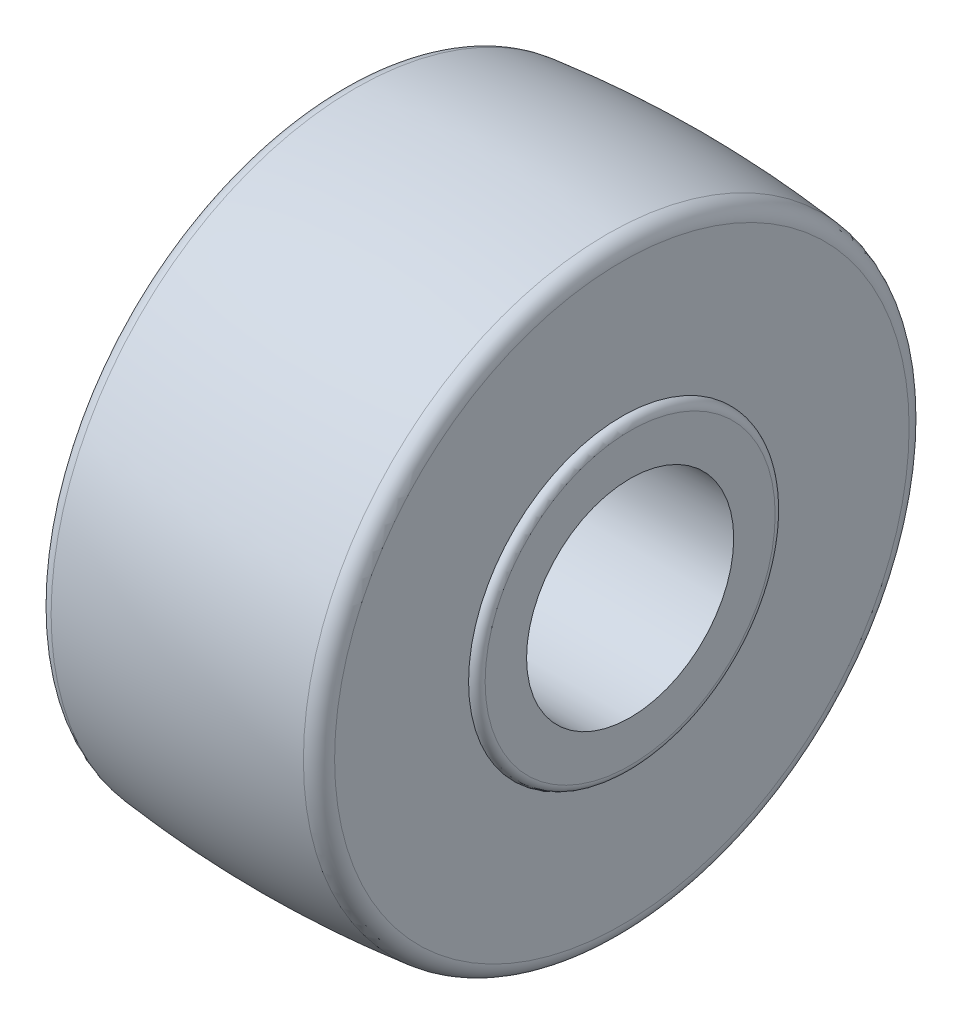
ISO-10303-21;
HEADER;
FILE_DESCRIPTION(('STEP AP214'),'2;1');
FILE_NAME('part.step','',(''),(''),'','','');
FILE_SCHEMA(('AUTOMOTIVE_DESIGN { 1 0 10303 214 1 1 1 1 }'));
ENDSEC;
DATA;
#1=APPLICATION_CONTEXT('core data for automotive mechanical design processes');
#2=APPLICATION_PROTOCOL_DEFINITION('international standard','automotive_design',2000,#1);
#3=PRODUCT_CONTEXT('',#1,'mechanical');
#4=PRODUCT('Part','Part','',(#3));
#5=PRODUCT_RELATED_PRODUCT_CATEGORY('part','',(#4));
#6=PRODUCT_DEFINITION_FORMATION('','',#4);
#7=PRODUCT_DEFINITION_CONTEXT('part definition',#1,'design');
#8=PRODUCT_DEFINITION('design','',#6,#7);
#9=PRODUCT_DEFINITION_SHAPE('','',#8);
#10=(LENGTH_UNIT() NAMED_UNIT(*) SI_UNIT(.MILLI.,.METRE.));
#11=(NAMED_UNIT(*) PLANE_ANGLE_UNIT() SI_UNIT($,.RADIAN.));
#12=(NAMED_UNIT(*) SI_UNIT($,.STERADIAN.) SOLID_ANGLE_UNIT());
#13=UNCERTAINTY_MEASURE_WITH_UNIT(LENGTH_MEASURE(1.E-05),#10,'distance_accuracy_value','');
#14=(GEOMETRIC_REPRESENTATION_CONTEXT(3) GLOBAL_UNCERTAINTY_ASSIGNED_CONTEXT((#13)) GLOBAL_UNIT_ASSIGNED_CONTEXT((#10,
#11,#12)) REPRESENTATION_CONTEXT('',''));
#15=CARTESIAN_POINT('',(0.,0.,0.));
#16=DIRECTION('',(0.,0.,1.));
#17=DIRECTION('',(1.,0.,0.));
#18=AXIS2_PLACEMENT_3D('',#15,#16,#17);
#19=CARTESIAN_POINT('',(18.,0.,0.));
#20=DIRECTION('',(-1.,0.,0.));
#21=DIRECTION('',(0.,0.,1.));
#22=AXIS2_PLACEMENT_3D('',#19,#20,#21);
#23=CYLINDRICAL_SURFACE('',#22,12.5);
#24=CARTESIAN_POINT('',(18.,0.,0.));
#25=DIRECTION('',(-1.,0.,0.));
#26=DIRECTION('',(0.,0.,1.));
#27=AXIS2_PLACEMENT_3D('',#24,#25,#26);
#28=CIRCLE('',#27,12.5);
#29=CARTESIAN_POINT('',(18.,0.,12.5));
#30=VERTEX_POINT('',#29);
#31=EDGE_CURVE('E141',#30,#30,#28,.F.);
#32=ORIENTED_EDGE('',*,*,#31,.T.);
#33=EDGE_LOOP('',(#32));
#34=FACE_BOUND('',#33,.T.);
#35=CARTESIAN_POINT('',(-18.,0.,0.));
#36=DIRECTION('',(-1.,0.,0.));
#37=DIRECTION('',(0.,0.,1.));
#38=AXIS2_PLACEMENT_3D('',#35,#36,#37);
#39=CIRCLE('',#38,12.5);
#40=CARTESIAN_POINT('',(-18.,0.,12.5));
#41=VERTEX_POINT('',#40);
#42=EDGE_CURVE('E64',#41,#41,#39,.T.);
#43=ORIENTED_EDGE('',*,*,#42,.T.);
#44=EDGE_LOOP('',(#43));
#45=FACE_BOUND('',#44,.T.);
#46=ADVANCED_FACE('F17',(#34,#45),#23,.F.);
#47=CARTESIAN_POINT('',(18.,12.5,0.));
#48=DIRECTION('',(-1.,0.,0.));
#49=DIRECTION('',(0.,0.,1.));
#50=AXIS2_PLACEMENT_3D('',#47,#48,#49);
#51=PLANE('',#50);
#52=ORIENTED_EDGE('',*,*,#31,.F.);
#53=EDGE_LOOP('',(#52));
#54=FACE_BOUND('',#53,.T.);
#55=CARTESIAN_POINT('',(18.,0.,0.));
#56=DIRECTION('',(-1.,0.,0.));
#57=DIRECTION('',(0.,0.,-1.));
#58=AXIS2_PLACEMENT_3D('',#55,#56,#57);
#59=CIRCLE('',#58,17.5);
#60=CARTESIAN_POINT('',(18.,0.,-17.5));
#61=VERTEX_POINT('',#60);
#62=CARTESIAN_POINT('',(18.,0.,17.5));
#63=VERTEX_POINT('',#62);
#64=EDGE_CURVE('E60',#61,#63,#59,.T.);
#65=ORIENTED_EDGE('',*,*,#64,.F.);
#66=CARTESIAN_POINT('',(18.,0.,0.));
#67=DIRECTION('',(-1.,0.,0.));
#68=DIRECTION('',(0.,0.,1.));
#69=AXIS2_PLACEMENT_3D('',#66,#67,#68);
#70=CIRCLE('',#69,17.5);
#71=EDGE_CURVE('E57',#63,#61,#70,.T.);
#72=ORIENTED_EDGE('',*,*,#71,.F.);
#73=EDGE_LOOP('',(#65,#72));
#74=FACE_BOUND('',#73,.T.);
#75=ADVANCED_FACE('F62',(#54,#74),#51,.F.);
#76=CARTESIAN_POINT('',(-18.,17.5,0.));
#77=DIRECTION('',(1.,0.,0.));
#78=DIRECTION('',(0.,0.,-1.));
#79=AXIS2_PLACEMENT_3D('',#76,#77,#78);
#80=PLANE('',#79);
#81=CARTESIAN_POINT('',(-18.,0.,0.));
#82=DIRECTION('',(1.,0.,0.));
#83=DIRECTION('',(0.,0.,1.));
#84=AXIS2_PLACEMENT_3D('',#81,#82,#83);
#85=CIRCLE('',#84,17.5);
#86=CARTESIAN_POINT('',(-18.,0.,17.5));
#87=VERTEX_POINT('',#86);
#88=CARTESIAN_POINT('',(-18.,0.,-17.5));
#89=VERTEX_POINT('',#88);
#90=EDGE_CURVE('E69',#87,#89,#85,.T.);
#91=ORIENTED_EDGE('',*,*,#90,.F.);
#92=CARTESIAN_POINT('',(-18.,0.,0.));
#93=DIRECTION('',(1.,0.,0.));
#94=DIRECTION('',(0.,0.,-1.));
#95=AXIS2_PLACEMENT_3D('',#92,#93,#94);
#96=CIRCLE('',#95,17.5);
#97=EDGE_CURVE('E114',#89,#87,#96,.T.);
#98=ORIENTED_EDGE('',*,*,#97,.F.);
#99=EDGE_LOOP('',(#91,#98));
#100=FACE_BOUND('',#99,.T.);
#101=ORIENTED_EDGE('',*,*,#42,.F.);
#102=EDGE_LOOP('',(#101));
#103=FACE_BOUND('',#102,.T.);
#104=ADVANCED_FACE('F90',(#100,#103),#80,.F.);
#105=CARTESIAN_POINT('',(17.,0.,0.));
#106=DIRECTION('',(-1.,0.,0.));
#107=DIRECTION('',(0.,0.,1.));
#108=AXIS2_PLACEMENT_3D('',#105,#106,#107);
#109=TOROIDAL_SURFACE('',#108,17.5,1.00000000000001);
#110=CARTESIAN_POINT('',(17.,0.,0.));
#111=DIRECTION('',(-1.,0.,0.));
#112=DIRECTION('',(0.,0.,1.));
#113=AXIS2_PLACEMENT_3D('',#110,#111,#112);
#114=CIRCLE('',#113,18.5);
#115=CARTESIAN_POINT('',(17.,0.,18.5));
#116=VERTEX_POINT('',#115);
#117=EDGE_CURVE('E133',#116,#116,#114,.F.);
#118=ORIENTED_EDGE('',*,*,#117,.T.);
#119=EDGE_LOOP('',(#118));
#120=FACE_BOUND('',#119,.T.);
#121=ORIENTED_EDGE('',*,*,#71,.T.);
#122=ORIENTED_EDGE('',*,*,#64,.T.);
#123=EDGE_LOOP('',(#121,#122));
#124=FACE_BOUND('',#123,.T.);
#125=ADVANCED_FACE('F68',(#120,#124),#109,.T.);
#126=CARTESIAN_POINT('',(-17.,0.,0.));
#127=DIRECTION('',(-1.,0.,0.));
#128=DIRECTION('',(0.,0.,1.));
#129=AXIS2_PLACEMENT_3D('',#126,#127,#128);
#130=TOROIDAL_SURFACE('',#129,17.5,1.00000000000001);
#131=ORIENTED_EDGE('',*,*,#90,.T.);
#132=ORIENTED_EDGE('',*,*,#97,.T.);
#133=EDGE_LOOP('',(#131,#132));
#134=FACE_BOUND('',#133,.T.);
#135=CARTESIAN_POINT('',(-17.,0.,0.));
#136=DIRECTION('',(-1.,0.,0.));
#137=DIRECTION('',(0.,0.,1.));
#138=AXIS2_PLACEMENT_3D('',#135,#136,#137);
#139=CIRCLE('',#138,18.5);
#140=CARTESIAN_POINT('',(-17.,0.,18.5));
#141=VERTEX_POINT('',#140);
#142=EDGE_CURVE('E77',#141,#141,#139,.T.);
#143=ORIENTED_EDGE('',*,*,#142,.T.);
#144=EDGE_LOOP('',(#143));
#145=FACE_BOUND('',#144,.T.);
#146=ADVANCED_FACE('F89',(#134,#145),#130,.T.);
#147=CARTESIAN_POINT('',(17.,18.5,0.));
#148=DIRECTION('',(-1.,0.,0.));
#149=DIRECTION('',(0.,0.,1.));
#150=AXIS2_PLACEMENT_3D('',#147,#148,#149);
#151=PLANE('',#150);
#152=ORIENTED_EDGE('',*,*,#117,.F.);
#153=EDGE_LOOP('',(#152));
#154=FACE_BOUND('',#153,.T.);
#155=CARTESIAN_POINT('',(17.,0.,0.));
#156=DIRECTION('',(-1.,0.,0.));
#157=DIRECTION('',(0.,0.,-1.));
#158=AXIS2_PLACEMENT_3D('',#155,#156,#157);
#159=CIRCLE('',#158,34.667182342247);
#160=CARTESIAN_POINT('',(17.,0.,-34.667182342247));
#161=VERTEX_POINT('',#160);
#162=CARTESIAN_POINT('',(17.,0.,34.667182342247));
#163=VERTEX_POINT('',#162);
#164=EDGE_CURVE('E137',#161,#163,#159,.T.);
#165=ORIENTED_EDGE('',*,*,#164,.F.);
#166=CARTESIAN_POINT('',(17.,0.,0.));
#167=DIRECTION('',(-1.,0.,0.));
#168=DIRECTION('',(0.,0.,1.));
#169=AXIS2_PLACEMENT_3D('',#166,#167,#168);
#170=CIRCLE('',#169,34.667182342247);
#171=EDGE_CURVE('E219',#163,#161,#170,.T.);
#172=ORIENTED_EDGE('',*,*,#171,.F.);
#173=EDGE_LOOP('',(#165,#172));
#174=FACE_BOUND('',#173,.T.);
#175=ADVANCED_FACE('F187',(#154,#174),#151,.F.);
#176=CARTESIAN_POINT('',(-17.,34.667182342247,0.));
#177=DIRECTION('',(1.,0.,0.));
#178=DIRECTION('',(0.,0.,-1.));
#179=AXIS2_PLACEMENT_3D('',#176,#177,#178);
#180=PLANE('',#179);
#181=CARTESIAN_POINT('',(-17.,0.,0.));
#182=DIRECTION('',(1.,0.,0.));
#183=DIRECTION('',(0.,0.,1.));
#184=AXIS2_PLACEMENT_3D('',#181,#182,#183);
#185=CIRCLE('',#184,34.667182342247);
#186=CARTESIAN_POINT('',(-17.,0.,34.667182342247));
#187=VERTEX_POINT('',#186);
#188=CARTESIAN_POINT('',(-17.,0.,-34.667182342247));
#189=VERTEX_POINT('',#188);
#190=EDGE_CURVE('E36',#187,#189,#185,.T.);
#191=ORIENTED_EDGE('',*,*,#190,.F.);
#192=CARTESIAN_POINT('',(-17.,0.,0.));
#193=DIRECTION('',(1.,0.,0.));
#194=DIRECTION('',(0.,0.,-1.));
#195=AXIS2_PLACEMENT_3D('',#192,#193,#194);
#196=CIRCLE('',#195,34.667182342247);
#197=EDGE_CURVE('E198',#189,#187,#196,.T.);
#198=ORIENTED_EDGE('',*,*,#197,.F.);
#199=EDGE_LOOP('',(#191,#198));
#200=FACE_BOUND('',#199,.T.);
#201=ORIENTED_EDGE('',*,*,#142,.F.);
#202=EDGE_LOOP('',(#201));
#203=FACE_BOUND('',#202,.T.);
#204=ADVANCED_FACE('F179',(#200,#203),#180,.F.);
#205=CARTESIAN_POINT('',(15.,0.,0.));
#206=DIRECTION('',(-1.,0.,0.));
#207=DIRECTION('',(0.,0.,1.));
#208=AXIS2_PLACEMENT_3D('',#205,#206,#207);
#209=TOROIDAL_SURFACE('',#208,34.667182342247,2.00000000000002);
#210=CARTESIAN_POINT('',(15.2214022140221,0.,0.));
#211=DIRECTION('',(-1.,0.,0.));
#212=DIRECTION('',(0.,0.,1.));
#213=AXIS2_PLACEMENT_3D('',#210,#211,#212);
#214=CIRCLE('',#213,36.6548898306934);
#215=CARTESIAN_POINT('',(15.2214022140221,0.,36.6548898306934));
#216=VERTEX_POINT('',#215);
#217=EDGE_CURVE('E28',#216,#216,#214,.T.);
#218=ORIENTED_EDGE('',*,*,#217,.F.);
#219=EDGE_LOOP('',(#218));
#220=FACE_BOUND('',#219,.T.);
#221=ORIENTED_EDGE('',*,*,#171,.T.);
#222=ORIENTED_EDGE('',*,*,#164,.T.);
#223=EDGE_LOOP('',(#221,#222));
#224=FACE_BOUND('',#223,.T.);
#225=ADVANCED_FACE('F164',(#220,#224),#209,.T.);
#226=CARTESIAN_POINT('',(-15.,0.,0.));
#227=DIRECTION('',(-1.,0.,0.));
#228=DIRECTION('',(0.,0.,1.));
#229=AXIS2_PLACEMENT_3D('',#226,#227,#228);
#230=TOROIDAL_SURFACE('',#229,34.667182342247,2.00000000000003);
#231=ORIENTED_EDGE('',*,*,#190,.T.);
#232=ORIENTED_EDGE('',*,*,#197,.T.);
#233=EDGE_LOOP('',(#231,#232));
#234=FACE_BOUND('',#233,.T.);
#235=CARTESIAN_POINT('',(-15.2214022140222,0.,0.));
#236=DIRECTION('',(-1.,0.,0.));
#237=DIRECTION('',(0.,0.,1.));
#238=AXIS2_PLACEMENT_3D('',#235,#236,#237);
#239=CIRCLE('',#238,36.6548898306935);
#240=CARTESIAN_POINT('',(-15.2214022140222,0.,36.6548898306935));
#241=VERTEX_POINT('',#240);
#242=EDGE_CURVE('E11',#241,#241,#239,.F.);
#243=ORIENTED_EDGE('',*,*,#242,.F.);
#244=EDGE_LOOP('',(#243));
#245=FACE_BOUND('',#244,.T.);
#246=ADVANCED_FACE('F152',(#234,#245),#230,.T.);
#247=CARTESIAN_POINT('',(-2.63677968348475E-13,0.,-100.000000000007));
#248=DIRECTION('',(0.,1.,0.));
#249=DIRECTION('',(0.,0.,1.));
#250=AXIS2_PLACEMENT_3D('',#247,#248,#249);
#251=CIRCLE('',#250,137.500000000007);
#252=TRIMMED_CURVE('',#251,(PARAMETER_VALUE(-0.756456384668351)),
(PARAMETER_VALUE(0.756456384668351)),.T.,.PARAMETER.);
#253=CARTESIAN_POINT('',(-2.63677968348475E-13,0.,0.));
#254=DIRECTION('',(-1.,0.,0.));
#255=AXIS1_PLACEMENT('',#253,#254);
#256=SURFACE_OF_REVOLUTION('',#252,#255);
#257=ORIENTED_EDGE('',*,*,#242,.T.);
#258=EDGE_LOOP('',(#257));
#259=FACE_BOUND('',#258,.T.);
#260=ORIENTED_EDGE('',*,*,#217,.T.);
#261=EDGE_LOOP('',(#260));
#262=FACE_BOUND('',#261,.T.);
#263=ADVANCED_FACE('F163',(#259,#262),#256,.F.);
#264=CLOSED_SHELL('',(#46,#75,#104,#125,#146,#175,#204,#225,#246,#263));
#265=MANIFOLD_SOLID_BREP('B1',#264);
#266=ADVANCED_BREP_SHAPE_REPRESENTATION('',(#18,#265),#14);
#267=SHAPE_DEFINITION_REPRESENTATION(#9,#266);
ENDSEC;
END-ISO-10303-21;
